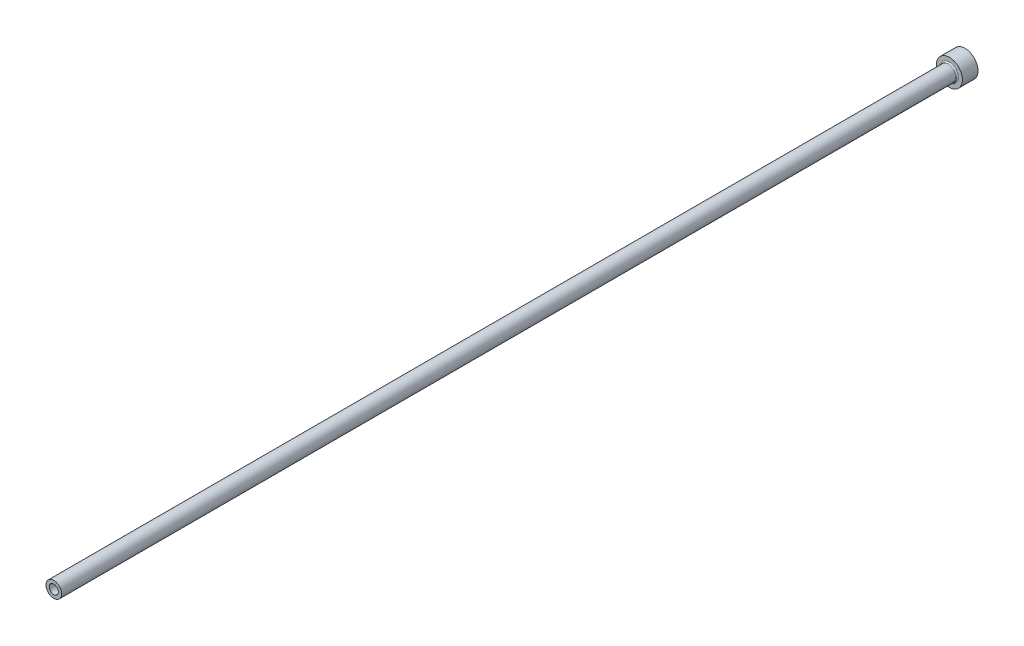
from build123d import *

# Parameters (mm, degrees)
HEAD_FILLET_R          = 0.5
ID_RELIEF_CHAMFER_SIZE = 0.5


with BuildPart() as part:
    # OD FV → Base Revolve (revolve)
    with BuildSketch(Plane(origin=(0, 0, 0), x_dir=(1, 0, 0), z_dir=(0, 1, 0))):
        Polygon((0, -350), (3, -350), (3, -6), (5, -6), (5, 0), (0, 0), align=None)
    revolve(axis=Axis((0, 0, 350), (0, 0, -1)))

    # ID FV → Hole (revolve, cut)
    with BuildSketch(Plane(origin=(0, 0, 0), x_dir=(1, 0, 0), z_dir=(0, 1, 0))):
        Polygon((0, -350), (1.75, -350), (1.75, -235), (2, -234.566987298), (2, 0), (0, 0), align=None)
    revolve(axis=Axis((0, 0, 350), (0, 0, -1)), mode=Mode.SUBTRACT)

    # Head Fillet
    head_fillet_edges = [part.edges().sort_by_distance(p)[0] for p in [
        (-3, 0, 6),
    ]]
    fillet(head_fillet_edges, radius=HEAD_FILLET_R)

    # ID Relief Chamfer
    id_relief_chamfer_edges = [part.edges().sort_by_distance(p)[0] for p in [
        (-2, 0, 0),
    ]]
    chamfer(id_relief_chamfer_edges, length=ID_RELIEF_CHAMFER_SIZE)


solid = part.part
